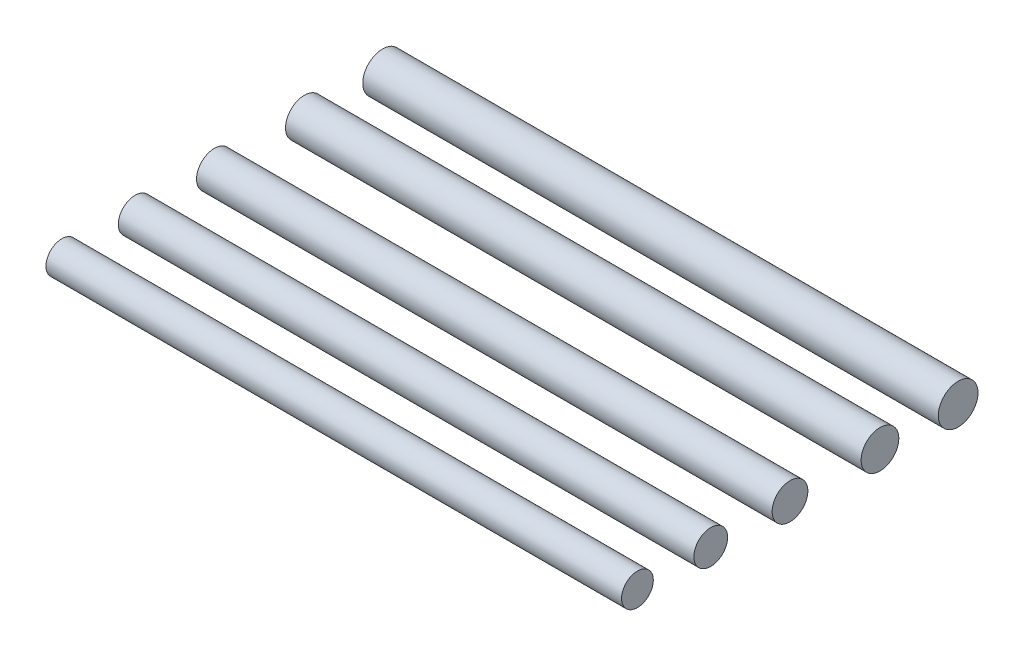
from build123d import *

# Parameters (mm, degrees)
SKETCH1_R             = 3
BOSS_EXTRUDE1_DEPTH   = 87
SKETCH1_R_2           = 2.85
BOSS_EXTRUDE1_2_DEPTH = 87
SKETCH1_R_3           = 2.7
BOSS_EXTRUDE1_3_DEPTH = 87
SKETCH1_R_4           = 2.55
BOSS_EXTRUDE1_4_DEPTH = 87
SKETCH1_R_5           = 2.4
BOSS_EXTRUDE1_5_DEPTH = 87


with BuildPart() as part:
    # Sketch1 → Boss-Extrude1 (new body)
    with BuildSketch(Plane(origin=(0, 0, 0), x_dir=(0, 0, -1), z_dir=(1, 0, 0))):
        Circle(SKETCH1_R)
    extrude(amount=-BOSS_EXTRUDE1_DEPTH)


with BuildPart() as body_2:
    # Sketch1 → Boss-Extrude1 2 (new body)
    with BuildSketch(Plane(origin=(0, 0, 0), x_dir=(0, 0, -1), z_dir=(1, 0, 0))):
        with Locations((-11.818326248, 0)):
            Circle(SKETCH1_R_2)
    extrude(amount=-BOSS_EXTRUDE1_2_DEPTH)


with BuildPart() as body_3:
    # Sketch1 → Boss-Extrude1 3 (new body)
    with BuildSketch(Plane(origin=(0, 0, 0), x_dir=(0, 0, -1), z_dir=(1, 0, 0))):
        with Locations((-25.418350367, 0)):
            Circle(SKETCH1_R_3)
    extrude(amount=-BOSS_EXTRUDE1_3_DEPTH)


with BuildPart() as body_4:
    # Sketch1 → Boss-Extrude1 4 (new body)
    with BuildSketch(Plane(origin=(0, 0, 0), x_dir=(0, 0, -1), z_dir=(1, 0, 0))):
        with Locations((-37.396970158, 0)):
            Circle(SKETCH1_R_4)
    extrude(amount=-BOSS_EXTRUDE1_4_DEPTH)


with BuildPart() as body_5:
    # Sketch1 → Boss-Extrude1 5 (new body)
    with BuildSketch(Plane(origin=(0, 0, 0), x_dir=(0, 0, -1), z_dir=(1, 0, 0))):
        with Locations((-48.477012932, 0)):
            Circle(SKETCH1_R_5)
    extrude(amount=-BOSS_EXTRUDE1_5_DEPTH)


solid = Compound([part.part, body_2.part, body_3.part, body_4.part, body_5.part])
